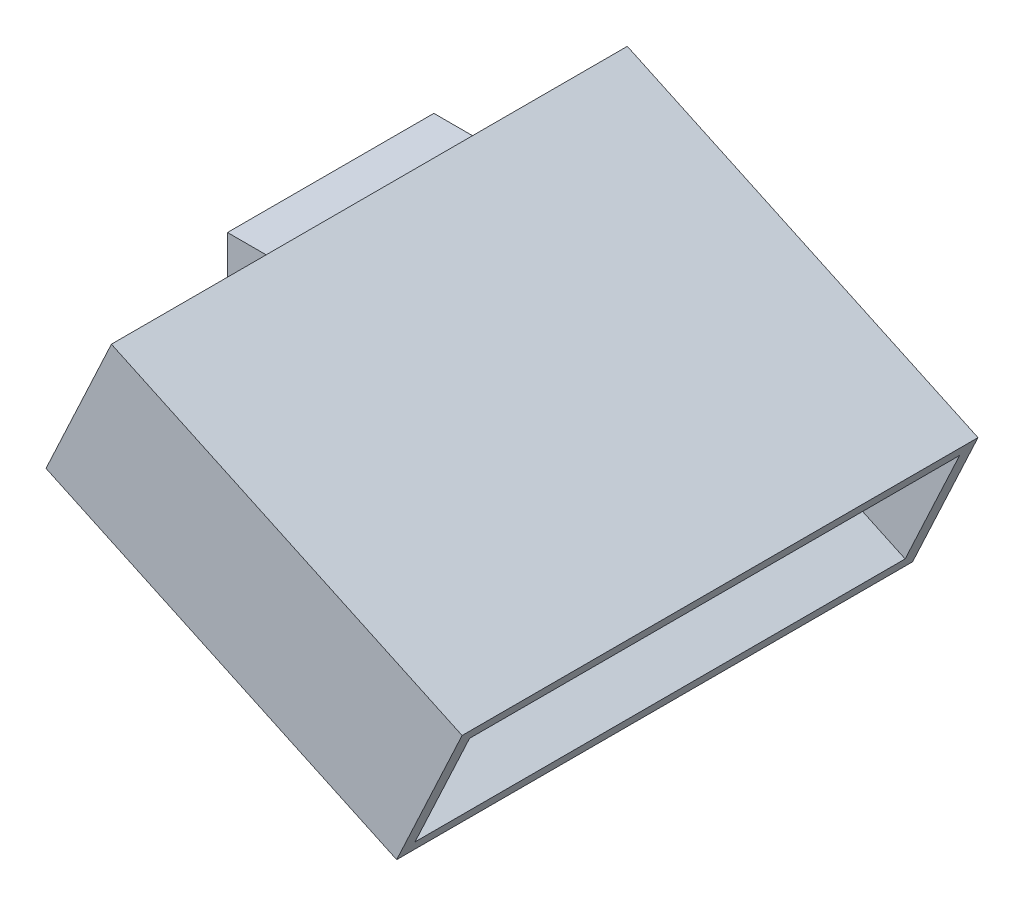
from build123d import *

# Parameters (mm, degrees)
SKETCH_1_W          = 80
SKETCH_1_H          = 29.62
SKETCH_1_W_2        = 70
SKETCH_1_H_2        = 19.62
EXTRUDE_1_DEPTH     = 15
SKETCH_6_W          = 200
SKETCH_6_H          = 150
EXTRUDE_4_DEPTH     = 60
SKETCH_8_W          = 190
SKETCH_8_H          = 50
CUT_EXTRUDE_6_DEPTH = 145
CUT_EXTRUDE_7_REACH = 203.975
SKETCH_9_W          = 70
SKETCH_9_H          = 21.64827477


with BuildPart() as part:
    # Sketch 1 → Extrude 1 (new body)
    with BuildSketch(Plane(origin=(0, 0, 0), x_dir=(0, 0, -1), z_dir=(1, 0, 0))):
        Rectangle(SKETCH_1_W, SKETCH_1_H)
        Rectangle(SKETCH_1_W_2, SKETCH_1_H_2, mode=Mode.SUBTRACT)
    extrude(amount=EXTRUDE_1_DEPTH)

    # Sketch 6 → Extrude 4 (add)
    with BuildSketch(Plane(origin=(8.351652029, 17.910175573, 0), x_dir=(0, 0, 1), z_dir=(-0.42261826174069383, -0.9063077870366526, 0))):
        with Locations((0, -82.335640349)):
            Rectangle(SKETCH_6_W, SKETCH_6_H)
    extrude(amount=EXTRUDE_4_DEPTH)

    # Sketch 8 → Cut-Extrude 6 (cut)
    with BuildSketch(Plane(origin=(142.594516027, -66.492914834, 0), x_dir=(0, 0, -1), z_dir=(0.9063077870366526, -0.4226182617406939, 0))):
        with Locations((0, -10.238307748)):
            Rectangle(SKETCH_8_W, SKETCH_8_H)
    extrude(amount=-CUT_EXTRUDE_6_DEPTH, mode=Mode.SUBTRACT)

    # Sketch 9 → Cut-Extrude 7 (cut, up to next)
    with BuildSketch(Plane(origin=(6.648347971, -3.100175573, 0), x_dir=(0, 0, 1), z_dir=(-0.9063077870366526, 0.4226182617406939, 0)), mode=Mode.PRIVATE) as cut_extrude_7_sk1:
        with Locations((0, 3.420665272)):
            Rectangle(SKETCH_9_W, SKETCH_9_H)
    cut_extrude_7_tool1 = extrude(cut_extrude_7_sk1.sketch, amount=-CUT_EXTRUDE_7_REACH, mode=Mode.PRIVATE) & part.part
    add(cut_extrude_7_tool1.solids().sort_by_distance((8.093984, 0, 0))[0], mode=Mode.SUBTRACT)


solid = part.part
